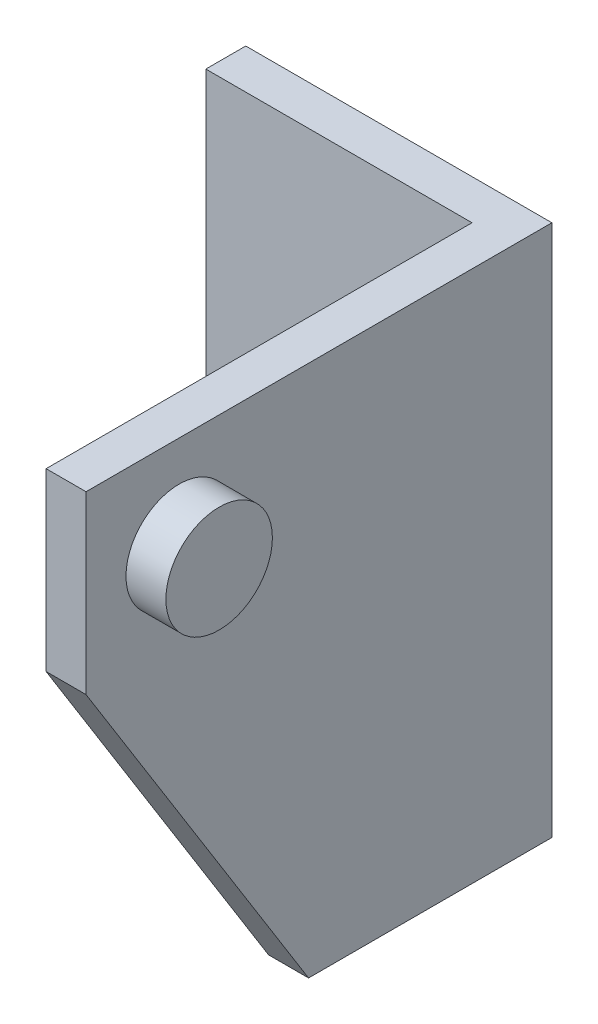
ISO-10303-21;
HEADER;
FILE_DESCRIPTION(('STEP AP214'),'2;1');
FILE_NAME('part.step','',(''),(''),'','','');
FILE_SCHEMA(('AUTOMOTIVE_DESIGN { 1 0 10303 214 1 1 1 1 }'));
ENDSEC;
DATA;
#1=APPLICATION_CONTEXT('core data for automotive mechanical design processes');
#2=APPLICATION_PROTOCOL_DEFINITION('international standard','automotive_design',2000,#1);
#3=PRODUCT_CONTEXT('',#1,'mechanical');
#4=PRODUCT('Part','Part','',(#3));
#5=PRODUCT_RELATED_PRODUCT_CATEGORY('part','',(#4));
#6=PRODUCT_DEFINITION_FORMATION('','',#4);
#7=PRODUCT_DEFINITION_CONTEXT('part definition',#1,'design');
#8=PRODUCT_DEFINITION('design','',#6,#7);
#9=PRODUCT_DEFINITION_SHAPE('','',#8);
#10=(LENGTH_UNIT() NAMED_UNIT(*) SI_UNIT(.MILLI.,.METRE.));
#11=(NAMED_UNIT(*) PLANE_ANGLE_UNIT() SI_UNIT($,.RADIAN.));
#12=(NAMED_UNIT(*) SI_UNIT($,.STERADIAN.) SOLID_ANGLE_UNIT());
#13=UNCERTAINTY_MEASURE_WITH_UNIT(LENGTH_MEASURE(1.E-05),#10,'distance_accuracy_value','');
#14=(GEOMETRIC_REPRESENTATION_CONTEXT(3) GLOBAL_UNCERTAINTY_ASSIGNED_CONTEXT((#13)) GLOBAL_UNIT_ASSIGNED_CONTEXT((#10,
#11,#12)) REPRESENTATION_CONTEXT('',''));
#15=CARTESIAN_POINT('',(0.,0.,0.));
#16=DIRECTION('',(0.,0.,1.));
#17=DIRECTION('',(1.,0.,0.));
#18=AXIS2_PLACEMENT_3D('',#15,#16,#17);
#19=CARTESIAN_POINT('',(105.,94.,25.5));
#20=DIRECTION('',(-1.,0.,0.));
#21=DIRECTION('',(0.,0.,1.));
#22=AXIS2_PLACEMENT_3D('',#19,#20,#21);
#23=PLANE('',#22);
#24=CARTESIAN_POINT('',(105.,87.,50.5));
#25=DIRECTION('',(-1.,0.,0.));
#26=DIRECTION('',(0.,0.,1.));
#27=AXIS2_PLACEMENT_3D('',#24,#25,#26);
#28=CIRCLE('',#27,4.00000000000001);
#29=CARTESIAN_POINT('',(105.,87.,54.5));
#30=VERTEX_POINT('',#29);
#31=EDGE_CURVE('E40',#30,#30,#28,.F.);
#32=ORIENTED_EDGE('',*,*,#31,.F.);
#33=EDGE_LOOP('',(#32));
#34=FACE_BOUND('',#33,.T.);
#35=DIRECTION('',(0.,-0.848445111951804,-0.529283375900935));
#36=VECTOR('',#35,1.);
#37=CARTESIAN_POINT('',(105.,-3.18585089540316,5.10694222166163));
#38=LINE('',#37,#36);
#39=CARTESIAN_POINT('',(105.,80.8006028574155,57.5));
#40=VERTEX_POINT('',#39);
#41=CARTESIAN_POINT('',(105.,54.,40.7810474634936));
#42=VERTEX_POINT('',#41);
#43=EDGE_CURVE('E47',#40,#42,#38,.T.);
#44=ORIENTED_EDGE('',*,*,#43,.T.);
#45=DIRECTION('',(0.,0.,-1.));
#46=VECTOR('',#45,1.);
#47=CARTESIAN_POINT('',(105.,54.,25.5));
#48=LINE('',#47,#46);
#49=CARTESIAN_POINT('',(105.,54.,22.5));
#50=VERTEX_POINT('',#49);
#51=EDGE_CURVE('E129',#42,#50,#48,.T.);
#52=ORIENTED_EDGE('',*,*,#51,.T.);
#53=DIRECTION('',(0.,1.,0.));
#54=VECTOR('',#53,1.);
#55=CARTESIAN_POINT('',(105.,94.,22.5));
#56=LINE('',#55,#54);
#57=CARTESIAN_POINT('',(105.,94.,22.5));
#58=VERTEX_POINT('',#57);
#59=EDGE_CURVE('E121',#50,#58,#56,.T.);
#60=ORIENTED_EDGE('',*,*,#59,.T.);
#61=DIRECTION('',(0.,0.,-1.));
#62=VECTOR('',#61,1.);
#63=CARTESIAN_POINT('',(105.,94.,25.5));
#64=LINE('',#63,#62);
#65=CARTESIAN_POINT('',(105.,94.,57.5));
#66=VERTEX_POINT('',#65);
#67=EDGE_CURVE('E145',#66,#58,#64,.T.);
#68=ORIENTED_EDGE('',*,*,#67,.F.);
#69=DIRECTION('',(0.,1.,0.));
#70=VECTOR('',#69,1.);
#71=CARTESIAN_POINT('',(105.,94.,57.5));
#72=LINE('',#71,#70);
#73=EDGE_CURVE('E114',#40,#66,#72,.T.);
#74=ORIENTED_EDGE('',*,*,#73,.F.);
#75=EDGE_LOOP('',(#44,#52,#60,#68,#74));
#76=FACE_BOUND('',#75,.T.);
#77=ADVANCED_FACE('F33',(#34,#76),#23,.F.);
#78=CARTESIAN_POINT('',(105.,54.,25.5));
#79=DIRECTION('',(0.,1.,0.));
#80=DIRECTION('',(0.,0.,1.));
#81=AXIS2_PLACEMENT_3D('',#78,#79,#80);
#82=PLANE('',#81);
#83=DIRECTION('',(1.,0.,0.));
#84=VECTOR('',#83,1.);
#85=CARTESIAN_POINT('',(102.,54.,40.7810474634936));
#86=LINE('',#85,#84);
#87=CARTESIAN_POINT('',(102.,54.,40.7810474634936));
#88=VERTEX_POINT('',#87);
#89=EDGE_CURVE('E97',#88,#42,#86,.T.);
#90=ORIENTED_EDGE('',*,*,#89,.F.);
#91=DIRECTION('',(0.,0.,-1.));
#92=VECTOR('',#91,1.);
#93=CARTESIAN_POINT('',(102.,54.,57.5));
#94=LINE('',#93,#92);
#95=CARTESIAN_POINT('',(102.,54.,25.5));
#96=VERTEX_POINT('',#95);
#97=EDGE_CURVE('E105',#88,#96,#94,.T.);
#98=ORIENTED_EDGE('',*,*,#97,.T.);
#99=DIRECTION('',(1.,0.,0.));
#100=VECTOR('',#99,1.);
#101=CARTESIAN_POINT('',(105.,54.,25.5));
#102=LINE('',#101,#100);
#103=CARTESIAN_POINT('',(82.,54.,25.5));
#104=VERTEX_POINT('',#103);
#105=EDGE_CURVE('E127',#104,#96,#102,.T.);
#106=ORIENTED_EDGE('',*,*,#105,.F.);
#107=DIRECTION('',(0.,0.,-1.));
#108=VECTOR('',#107,1.);
#109=CARTESIAN_POINT('',(82.,54.,25.5));
#110=LINE('',#109,#108);
#111=CARTESIAN_POINT('',(82.,54.,22.5));
#112=VERTEX_POINT('',#111);
#113=EDGE_CURVE('E139',#104,#112,#110,.T.);
#114=ORIENTED_EDGE('',*,*,#113,.T.);
#115=DIRECTION('',(1.,0.,0.));
#116=VECTOR('',#115,1.);
#117=CARTESIAN_POINT('',(105.,54.,22.5));
#118=LINE('',#117,#116);
#119=EDGE_CURVE('E125',#112,#50,#118,.T.);
#120=ORIENTED_EDGE('',*,*,#119,.T.);
#121=ORIENTED_EDGE('',*,*,#51,.F.);
#122=EDGE_LOOP('',(#90,#98,#106,#114,#120,#121));
#123=FACE_BOUND('',#122,.T.);
#124=ADVANCED_FACE('F154',(#123),#82,.F.);
#125=CARTESIAN_POINT('',(102.,94.,57.5));
#126=DIRECTION('',(1.,0.,0.));
#127=DIRECTION('',(0.,0.,-1.));
#128=AXIS2_PLACEMENT_3D('',#125,#126,#127);
#129=PLANE('',#128);
#130=CARTESIAN_POINT('',(102.,87.,50.5));
#131=DIRECTION('',(1.,0.,0.));
#132=DIRECTION('',(0.,0.,-1.));
#133=AXIS2_PLACEMENT_3D('',#130,#131,#132);
#134=CIRCLE('',#133,4.00000000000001);
#135=CARTESIAN_POINT('',(102.,87.,46.5));
#136=VERTEX_POINT('',#135);
#137=EDGE_CURVE('E11',#136,#136,#134,.F.);
#138=ORIENTED_EDGE('',*,*,#137,.F.);
#139=EDGE_LOOP('',(#138));
#140=FACE_BOUND('',#139,.T.);
#141=DIRECTION('',(0.,-0.848445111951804,-0.529283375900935));
#142=VECTOR('',#141,1.);
#143=CARTESIAN_POINT('',(102.,-3.18585089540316,5.10694222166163));
#144=LINE('',#143,#142);
#145=CARTESIAN_POINT('',(102.,80.8006028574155,57.5));
#146=VERTEX_POINT('',#145);
#147=EDGE_CURVE('E92',#146,#88,#144,.T.);
#148=ORIENTED_EDGE('',*,*,#147,.F.);
#149=DIRECTION('',(0.,-1.,0.));
#150=VECTOR('',#149,1.);
#151=CARTESIAN_POINT('',(102.,94.,57.5));
#152=LINE('',#151,#150);
#153=CARTESIAN_POINT('',(102.,94.,57.5));
#154=VERTEX_POINT('',#153);
#155=EDGE_CURVE('E104',#154,#146,#152,.T.);
#156=ORIENTED_EDGE('',*,*,#155,.F.);
#157=DIRECTION('',(0.,0.,-1.));
#158=VECTOR('',#157,1.);
#159=CARTESIAN_POINT('',(102.,94.,57.5));
#160=LINE('',#159,#158);
#161=CARTESIAN_POINT('',(102.,94.,25.5));
#162=VERTEX_POINT('',#161);
#163=EDGE_CURVE('E112',#154,#162,#160,.T.);
#164=ORIENTED_EDGE('',*,*,#163,.T.);
#165=DIRECTION('',(0.,-1.,0.));
#166=VECTOR('',#165,1.);
#167=CARTESIAN_POINT('',(102.,94.,25.5));
#168=LINE('',#167,#166);
#169=EDGE_CURVE('E55',#162,#96,#168,.T.);
#170=ORIENTED_EDGE('',*,*,#169,.T.);
#171=ORIENTED_EDGE('',*,*,#97,.F.);
#172=EDGE_LOOP('',(#148,#156,#164,#170,#171));
#173=FACE_BOUND('',#172,.T.);
#174=ADVANCED_FACE('F102',(#140,#173),#129,.F.);
#175=CARTESIAN_POINT('',(0.,0.,57.5));
#176=DIRECTION('',(0.,0.,-1.));
#177=DIRECTION('',(-1.,0.,0.));
#178=AXIS2_PLACEMENT_3D('',#175,#176,#177);
#179=PLANE('',#178);
#180=DIRECTION('',(1.,0.,0.));
#181=VECTOR('',#180,1.);
#182=CARTESIAN_POINT('',(102.,80.8006028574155,57.5));
#183=LINE('',#182,#181);
#184=EDGE_CURVE('E89',#146,#40,#183,.T.);
#185=ORIENTED_EDGE('',*,*,#184,.T.);
#186=ORIENTED_EDGE('',*,*,#73,.T.);
#187=DIRECTION('',(-1.,0.,0.));
#188=VECTOR('',#187,1.);
#189=CARTESIAN_POINT('',(105.,94.,57.5));
#190=LINE('',#189,#188);
#191=EDGE_CURVE('E109',#66,#154,#190,.T.);
#192=ORIENTED_EDGE('',*,*,#191,.T.);
#193=ORIENTED_EDGE('',*,*,#155,.T.);
#194=EDGE_LOOP('',(#185,#186,#192,#193));
#195=FACE_BOUND('',#194,.T.);
#196=ADVANCED_FACE('F107',(#195),#179,.F.);
#197=CARTESIAN_POINT('',(0.,0.,25.5));
#198=DIRECTION('',(0.,0.,-1.));
#199=DIRECTION('',(-1.,0.,0.));
#200=AXIS2_PLACEMENT_3D('',#197,#198,#199);
#201=PLANE('',#200);
#202=ORIENTED_EDGE('',*,*,#169,.F.);
#203=DIRECTION('',(-1.,0.,0.));
#204=VECTOR('',#203,1.);
#205=CARTESIAN_POINT('',(105.,94.,25.5));
#206=LINE('',#205,#204);
#207=CARTESIAN_POINT('',(82.,94.,25.5));
#208=VERTEX_POINT('',#207);
#209=EDGE_CURVE('E122',#162,#208,#206,.T.);
#210=ORIENTED_EDGE('',*,*,#209,.T.);
#211=DIRECTION('',(0.,-1.,0.));
#212=VECTOR('',#211,1.);
#213=CARTESIAN_POINT('',(82.,94.,25.5));
#214=LINE('',#213,#212);
#215=EDGE_CURVE('E124',#208,#104,#214,.T.);
#216=ORIENTED_EDGE('',*,*,#215,.T.);
#217=ORIENTED_EDGE('',*,*,#105,.T.);
#218=EDGE_LOOP('',(#202,#210,#216,#217));
#219=FACE_BOUND('',#218,.T.);
#220=ADVANCED_FACE('F171',(#219),#201,.F.);
#221=CARTESIAN_POINT('',(105.,94.,25.5));
#222=DIRECTION('',(0.,-1.,0.));
#223=DIRECTION('',(0.,0.,-1.));
#224=AXIS2_PLACEMENT_3D('',#221,#222,#223);
#225=PLANE('',#224);
#226=DIRECTION('',(-1.,0.,0.));
#227=VECTOR('',#226,1.);
#228=CARTESIAN_POINT('',(105.,94.,22.5));
#229=LINE('',#228,#227);
#230=CARTESIAN_POINT('',(82.,94.,22.5));
#231=VERTEX_POINT('',#230);
#232=EDGE_CURVE('E132',#58,#231,#229,.T.);
#233=ORIENTED_EDGE('',*,*,#232,.T.);
#234=DIRECTION('',(0.,0.,-1.));
#235=VECTOR('',#234,1.);
#236=CARTESIAN_POINT('',(82.,94.,25.5));
#237=LINE('',#236,#235);
#238=EDGE_CURVE('E142',#208,#231,#237,.T.);
#239=ORIENTED_EDGE('',*,*,#238,.F.);
#240=ORIENTED_EDGE('',*,*,#209,.F.);
#241=ORIENTED_EDGE('',*,*,#163,.F.);
#242=ORIENTED_EDGE('',*,*,#191,.F.);
#243=ORIENTED_EDGE('',*,*,#67,.T.);
#244=EDGE_LOOP('',(#233,#239,#240,#241,#242,#243));
#245=FACE_BOUND('',#244,.T.);
#246=ADVANCED_FACE('F168',(#245),#225,.F.);
#247=CARTESIAN_POINT('',(82.,94.,25.5));
#248=DIRECTION('',(1.,0.,0.));
#249=DIRECTION('',(0.,0.,-1.));
#250=AXIS2_PLACEMENT_3D('',#247,#248,#249);
#251=PLANE('',#250);
#252=DIRECTION('',(0.,-1.,0.));
#253=VECTOR('',#252,1.);
#254=CARTESIAN_POINT('',(82.,94.,22.5));
#255=LINE('',#254,#253);
#256=EDGE_CURVE('E134',#231,#112,#255,.T.);
#257=ORIENTED_EDGE('',*,*,#256,.T.);
#258=ORIENTED_EDGE('',*,*,#113,.F.);
#259=ORIENTED_EDGE('',*,*,#215,.F.);
#260=ORIENTED_EDGE('',*,*,#238,.T.);
#261=EDGE_LOOP('',(#257,#258,#259,#260));
#262=FACE_BOUND('',#261,.T.);
#263=ADVANCED_FACE('F173',(#262),#251,.F.);
#264=CARTESIAN_POINT('',(0.,0.,22.5));
#265=DIRECTION('',(0.,0.,-1.));
#266=DIRECTION('',(-1.,0.,0.));
#267=AXIS2_PLACEMENT_3D('',#264,#265,#266);
#268=PLANE('',#267);
#269=ORIENTED_EDGE('',*,*,#59,.F.);
#270=ORIENTED_EDGE('',*,*,#119,.F.);
#271=ORIENTED_EDGE('',*,*,#256,.F.);
#272=ORIENTED_EDGE('',*,*,#232,.F.);
#273=EDGE_LOOP('',(#269,#270,#271,#272));
#274=FACE_BOUND('',#273,.T.);
#275=ADVANCED_FACE('F166',(#274),#268,.T.);
#276=CARTESIAN_POINT('',(108.,87.,50.5));
#277=DIRECTION('',(-1.,0.,0.));
#278=DIRECTION('',(0.,0.,1.));
#279=AXIS2_PLACEMENT_3D('',#276,#277,#278);
#280=CYLINDRICAL_SURFACE('',#279,4.00000000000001);
#281=CARTESIAN_POINT('',(108.,87.,50.5));
#282=DIRECTION('',(1.,0.,0.));
#283=DIRECTION('',(0.,0.,-1.));
#284=AXIS2_PLACEMENT_3D('',#281,#282,#283);
#285=CIRCLE('',#284,4.00000000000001);
#286=CARTESIAN_POINT('',(108.,87.,46.5));
#287=VERTEX_POINT('',#286);
#288=EDGE_CURVE('E118',#287,#287,#285,.T.);
#289=ORIENTED_EDGE('',*,*,#288,.F.);
#290=EDGE_LOOP('',(#289));
#291=FACE_BOUND('',#290,.T.);
#292=ORIENTED_EDGE('',*,*,#31,.T.);
#293=EDGE_LOOP('',(#292));
#294=FACE_BOUND('',#293,.T.);
#295=ADVANCED_FACE('F150',(#291,#294),#280,.T.);
#296=CARTESIAN_POINT('',(108.,87.,50.5));
#297=DIRECTION('',(1.,0.,0.));
#298=DIRECTION('',(0.,0.,-1.));
#299=AXIS2_PLACEMENT_3D('',#296,#297,#298);
#300=PLANE('',#299);
#301=ORIENTED_EDGE('',*,*,#288,.T.);
#302=EDGE_LOOP('',(#301));
#303=FACE_BOUND('',#302,.T.);
#304=ADVANCED_FACE('F193',(#303),#300,.T.);
#305=CARTESIAN_POINT('',(102.,-3.18585089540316,5.10694222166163));
#306=DIRECTION('',(0.,-0.529283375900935,0.848445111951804));
#307=DIRECTION('',(0.,-0.848445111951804,-0.529283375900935));
#308=AXIS2_PLACEMENT_3D('',#305,#306,#307);
#309=PLANE('',#308);
#310=ORIENTED_EDGE('',*,*,#43,.F.);
#311=ORIENTED_EDGE('',*,*,#184,.F.);
#312=ORIENTED_EDGE('',*,*,#147,.T.);
#313=ORIENTED_EDGE('',*,*,#89,.T.);
#314=EDGE_LOOP('',(#310,#311,#312,#313));
#315=FACE_BOUND('',#314,.T.);
#316=ADVANCED_FACE('F91',(#315),#309,.T.);
#317=CARTESIAN_POINT('',(99.,87.,50.5));
#318=DIRECTION('',(1.,0.,0.));
#319=DIRECTION('',(0.,0.,-1.));
#320=AXIS2_PLACEMENT_3D('',#317,#318,#319);
#321=CYLINDRICAL_SURFACE('',#320,4.00000000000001);
#322=CARTESIAN_POINT('',(99.,87.,50.5));
#323=DIRECTION('',(-1.,0.,0.));
#324=DIRECTION('',(0.,0.,1.));
#325=AXIS2_PLACEMENT_3D('',#322,#323,#324);
#326=CIRCLE('',#325,4.00000000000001);
#327=CARTESIAN_POINT('',(99.,87.,54.5));
#328=VERTEX_POINT('',#327);
#329=EDGE_CURVE('E157',#328,#328,#326,.T.);
#330=ORIENTED_EDGE('',*,*,#329,.F.);
#331=EDGE_LOOP('',(#330));
#332=FACE_BOUND('',#331,.T.);
#333=ORIENTED_EDGE('',*,*,#137,.T.);
#334=EDGE_LOOP('',(#333));
#335=FACE_BOUND('',#334,.T.);
#336=ADVANCED_FACE('F200',(#332,#335),#321,.T.);
#337=CARTESIAN_POINT('',(99.,87.,50.5));
#338=DIRECTION('',(-1.,0.,0.));
#339=DIRECTION('',(0.,0.,1.));
#340=AXIS2_PLACEMENT_3D('',#337,#338,#339);
#341=PLANE('',#340);
#342=ORIENTED_EDGE('',*,*,#329,.T.);
#343=EDGE_LOOP('',(#342));
#344=FACE_BOUND('',#343,.T.);
#345=ADVANCED_FACE('F203',(#344),#341,.T.);
#346=CLOSED_SHELL('',(#77,#124,#174,#196,#220,#246,#263,#275,#295,#304,#316,#336,#345));
#347=MANIFOLD_SOLID_BREP('B2',#346);
#348=ADVANCED_BREP_SHAPE_REPRESENTATION('',(#18,#347),#14);
#349=SHAPE_DEFINITION_REPRESENTATION(#9,#348);
ENDSEC;
END-ISO-10303-21;
